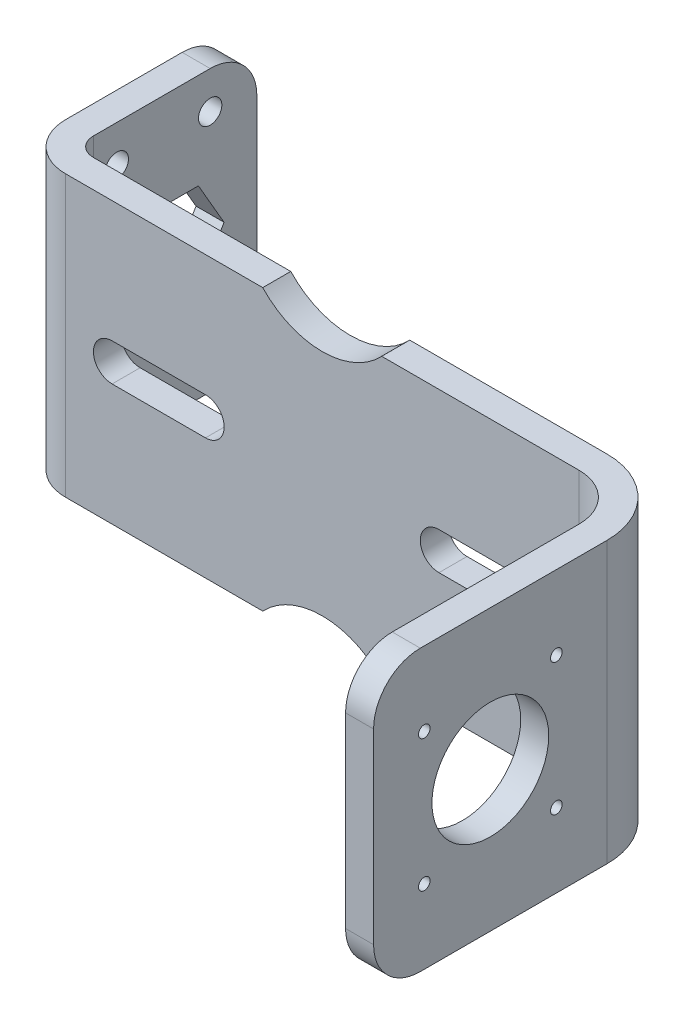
ISO-10303-21;
HEADER;
FILE_DESCRIPTION(('STEP AP214'),'2;1');
FILE_NAME('part.step','',(''),(''),'','','');
FILE_SCHEMA(('AUTOMOTIVE_DESIGN { 1 0 10303 214 1 1 1 1 }'));
ENDSEC;
DATA;
#1=APPLICATION_CONTEXT('core data for automotive mechanical design processes');
#2=APPLICATION_PROTOCOL_DEFINITION('international standard','automotive_design',2000,#1);
#3=PRODUCT_CONTEXT('',#1,'mechanical');
#4=PRODUCT('Part','Part','',(#3));
#5=PRODUCT_RELATED_PRODUCT_CATEGORY('part','',(#4));
#6=PRODUCT_DEFINITION_FORMATION('','',#4);
#7=PRODUCT_DEFINITION_CONTEXT('part definition',#1,'design');
#8=PRODUCT_DEFINITION('design','',#6,#7);
#9=PRODUCT_DEFINITION_SHAPE('','',#8);
#10=(LENGTH_UNIT() NAMED_UNIT(*) SI_UNIT(.MILLI.,.METRE.));
#11=(NAMED_UNIT(*) PLANE_ANGLE_UNIT() SI_UNIT($,.RADIAN.));
#12=(NAMED_UNIT(*) SI_UNIT($,.STERADIAN.) SOLID_ANGLE_UNIT());
#13=UNCERTAINTY_MEASURE_WITH_UNIT(LENGTH_MEASURE(1.E-05),#10,'distance_accuracy_value','');
#14=(GEOMETRIC_REPRESENTATION_CONTEXT(3) GLOBAL_UNCERTAINTY_ASSIGNED_CONTEXT((#13)) GLOBAL_UNIT_ASSIGNED_CONTEXT((#10,
#11,#12)) REPRESENTATION_CONTEXT('',''));
#15=CARTESIAN_POINT('',(0.,0.,0.));
#16=DIRECTION('',(0.,0.,1.));
#17=DIRECTION('',(1.,0.,0.));
#18=AXIS2_PLACEMENT_3D('',#15,#16,#17);
#19=CARTESIAN_POINT('',(-55.,60.,-70.));
#20=DIRECTION('',(0.,-1.,0.));
#21=DIRECTION('',(-1.,0.,0.));
#22=AXIS2_PLACEMENT_3D('',#19,#20,#21);
#23=PLANE('',#22);
#24=DIRECTION('',(0.,0.,-1.));
#25=VECTOR('',#24,1.);
#26=CARTESIAN_POINT('',(65.,60.,-49.9999999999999));
#27=LINE('',#26,#25);
#28=CARTESIAN_POINT('',(65.,60.,-10.));
#29=VERTEX_POINT('',#28);
#30=CARTESIAN_POINT('',(65.,60.,-49.9999999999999));
#31=VERTEX_POINT('',#30);
#32=EDGE_CURVE('E441',#29,#31,#27,.T.);
#33=ORIENTED_EDGE('',*,*,#32,.F.);
#34=DIRECTION('',(-1.,0.,0.));
#35=VECTOR('',#34,1.);
#36=CARTESIAN_POINT('',(71.,60.,-10.));
#37=LINE('',#36,#35);
#38=CARTESIAN_POINT('',(71.,60.,-10.));
#39=VERTEX_POINT('',#38);
#40=EDGE_CURVE('E571',#29,#39,#37,.F.);
#41=ORIENTED_EDGE('',*,*,#40,.T.);
#42=DIRECTION('',(0.,0.,-1.));
#43=VECTOR('',#42,1.);
#44=CARTESIAN_POINT('',(71.,60.,-49.9999999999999));
#45=LINE('',#44,#43);
#46=CARTESIAN_POINT('',(71.,60.,-49.9999999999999));
#47=VERTEX_POINT('',#46);
#48=EDGE_CURVE('E443',#39,#47,#45,.T.);
#49=ORIENTED_EDGE('',*,*,#48,.T.);
#50=CARTESIAN_POINT('',(55.,60.,-50.));
#51=DIRECTION('',(0.,1.,0.));
#52=DIRECTION('',(1.,0.,0.));
#53=AXIS2_PLACEMENT_3D('',#50,#51,#52);
#54=CIRCLE('',#53,16.);
#55=CARTESIAN_POINT('',(54.9999999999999,60.,-66.));
#56=VERTEX_POINT('',#55);
#57=EDGE_CURVE('E445',#47,#56,#54,.T.);
#58=ORIENTED_EDGE('',*,*,#57,.T.);
#59=DIRECTION('',(-1.,0.,0.));
#60=VECTOR('',#59,1.);
#61=CARTESIAN_POINT('',(0.,60.,-66.));
#62=LINE('',#61,#60);
#63=CARTESIAN_POINT('',(12.737739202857,60.,-66.));
#64=VERTEX_POINT('',#63);
#65=EDGE_CURVE('E448',#56,#64,#62,.T.);
#66=ORIENTED_EDGE('',*,*,#65,.T.);
#67=DIRECTION('',(0.,0.,1.));
#68=VECTOR('',#67,1.);
#69=CARTESIAN_POINT('',(12.737739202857,60.,-105.));
#70=LINE('',#69,#68);
#71=CARTESIAN_POINT('',(12.737739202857,60.,-60.));
#72=VERTEX_POINT('',#71);
#73=EDGE_CURVE('E552',#64,#72,#70,.T.);
#74=ORIENTED_EDGE('',*,*,#73,.T.);
#75=DIRECTION('',(-1.,0.,0.));
#76=VECTOR('',#75,1.);
#77=CARTESIAN_POINT('',(0.,60.,-60.));
#78=LINE('',#77,#76);
#79=CARTESIAN_POINT('',(54.9999999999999,60.,-60.));
#80=VERTEX_POINT('',#79);
#81=EDGE_CURVE('E435',#80,#72,#78,.T.);
#82=ORIENTED_EDGE('',*,*,#81,.F.);
#83=CARTESIAN_POINT('',(55.,60.,-50.));
#84=DIRECTION('',(0.,1.,0.));
#85=DIRECTION('',(0.,0.,-1.));
#86=AXIS2_PLACEMENT_3D('',#83,#84,#85);
#87=CIRCLE('',#86,10.);
#88=EDGE_CURVE('E438',#31,#80,#87,.T.);
#89=ORIENTED_EDGE('',*,*,#88,.F.);
#90=EDGE_LOOP('',(#33,#41,#49,#58,#66,#74,#82,#89));
#91=FACE_BOUND('',#90,.T.);
#92=ADVANCED_FACE('F50',(#91),#23,.F.);
#93=CARTESIAN_POINT('',(-55.,0.,-70.));
#94=DIRECTION('',(0.,-1.,0.));
#95=DIRECTION('',(-1.,0.,0.));
#96=AXIS2_PLACEMENT_3D('',#93,#94,#95);
#97=PLANE('',#96);
#98=DIRECTION('',(0.,0.,-1.));
#99=VECTOR('',#98,1.);
#100=CARTESIAN_POINT('',(71.,0.,-49.9999999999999));
#101=LINE('',#100,#99);
#102=CARTESIAN_POINT('',(71.,0.,-9.99999999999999));
#103=VERTEX_POINT('',#102);
#104=CARTESIAN_POINT('',(71.,0.,-49.9999999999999));
#105=VERTEX_POINT('',#104);
#106=EDGE_CURVE('E471',#103,#105,#101,.T.);
#107=ORIENTED_EDGE('',*,*,#106,.F.);
#108=DIRECTION('',(-1.,0.,0.));
#109=VECTOR('',#108,1.);
#110=CARTESIAN_POINT('',(-55.,0.,-9.99999999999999));
#111=LINE('',#110,#109);
#112=CARTESIAN_POINT('',(65.,0.,-9.99999999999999));
#113=VERTEX_POINT('',#112);
#114=EDGE_CURVE('E555',#103,#113,#111,.T.);
#115=ORIENTED_EDGE('',*,*,#114,.T.);
#116=DIRECTION('',(0.,0.,-1.));
#117=VECTOR('',#116,1.);
#118=CARTESIAN_POINT('',(65.,0.,-49.9999999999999));
#119=LINE('',#118,#117);
#120=CARTESIAN_POINT('',(65.,0.,-49.9999999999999));
#121=VERTEX_POINT('',#120);
#122=EDGE_CURVE('E469',#113,#121,#119,.T.);
#123=ORIENTED_EDGE('',*,*,#122,.T.);
#124=CARTESIAN_POINT('',(55.,0.,-50.));
#125=DIRECTION('',(0.,1.,0.));
#126=DIRECTION('',(0.,0.,-1.));
#127=AXIS2_PLACEMENT_3D('',#124,#125,#126);
#128=CIRCLE('',#127,10.);
#129=CARTESIAN_POINT('',(54.9999999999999,0.,-60.));
#130=VERTEX_POINT('',#129);
#131=EDGE_CURVE('E466',#121,#130,#128,.T.);
#132=ORIENTED_EDGE('',*,*,#131,.T.);
#133=DIRECTION('',(-1.,0.,0.));
#134=VECTOR('',#133,1.);
#135=CARTESIAN_POINT('',(0.,0.,-60.));
#136=LINE('',#135,#134);
#137=CARTESIAN_POINT('',(12.737739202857,0.,-60.));
#138=VERTEX_POINT('',#137);
#139=EDGE_CURVE('E463',#130,#138,#136,.T.);
#140=ORIENTED_EDGE('',*,*,#139,.T.);
#141=DIRECTION('',(0.,0.,1.));
#142=VECTOR('',#141,1.);
#143=CARTESIAN_POINT('',(12.737739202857,0.,-105.));
#144=LINE('',#143,#142);
#145=CARTESIAN_POINT('',(12.737739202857,0.,-66.));
#146=VERTEX_POINT('',#145);
#147=EDGE_CURVE('E547',#146,#138,#144,.T.);
#148=ORIENTED_EDGE('',*,*,#147,.F.);
#149=DIRECTION('',(-1.,0.,0.));
#150=VECTOR('',#149,1.);
#151=CARTESIAN_POINT('',(0.,0.,-66.));
#152=LINE('',#151,#150);
#153=CARTESIAN_POINT('',(54.9999999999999,0.,-66.));
#154=VERTEX_POINT('',#153);
#155=EDGE_CURVE('E477',#154,#146,#152,.T.);
#156=ORIENTED_EDGE('',*,*,#155,.F.);
#157=CARTESIAN_POINT('',(55.,0.,-50.));
#158=DIRECTION('',(0.,1.,0.));
#159=DIRECTION('',(1.,0.,0.));
#160=AXIS2_PLACEMENT_3D('',#157,#158,#159);
#161=CIRCLE('',#160,16.);
#162=EDGE_CURVE('E473',#105,#154,#161,.T.);
#163=ORIENTED_EDGE('',*,*,#162,.F.);
#164=EDGE_LOOP('',(#107,#115,#123,#132,#140,#148,#156,#163));
#165=FACE_BOUND('',#164,.T.);
#166=ADVANCED_FACE('F625',(#165),#97,.T.);
#167=CARTESIAN_POINT('',(0.,60.,-60.));
#168=DIRECTION('',(0.,0.,1.));
#169=DIRECTION('',(1.,0.,0.));
#170=AXIS2_PLACEMENT_3D('',#167,#168,#169);
#171=PLANE('',#170);
#172=CARTESIAN_POINT('',(0.,72.,-60.));
#173=DIRECTION('',(0.,0.,1.));
#174=DIRECTION('',(1.,0.,0.));
#175=AXIS2_PLACEMENT_3D('',#172,#173,#174);
#176=CIRCLE('',#175,17.5);
#177=CARTESIAN_POINT('',(-12.737739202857,60.,-60.));
#178=VERTEX_POINT('',#177);
#179=EDGE_CURVE('E333',#178,#72,#176,.T.);
#180=ORIENTED_EDGE('',*,*,#179,.F.);
#181=CARTESIAN_POINT('',(-54.9999999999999,60.,-60.));
#182=VERTEX_POINT('',#181);
#183=EDGE_CURVE('E434',#178,#182,#78,.T.);
#184=ORIENTED_EDGE('',*,*,#183,.T.);
#185=DIRECTION('',(0.,-1.,0.));
#186=VECTOR('',#185,1.);
#187=CARTESIAN_POINT('',(-54.9999999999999,60.,-60.));
#188=LINE('',#187,#186);
#189=CARTESIAN_POINT('',(-54.9999999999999,0.,-60.));
#190=VERTEX_POINT('',#189);
#191=EDGE_CURVE('E503',#182,#190,#188,.T.);
#192=ORIENTED_EDGE('',*,*,#191,.T.);
#193=CARTESIAN_POINT('',(-12.737739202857,0.,-60.));
#194=VERTEX_POINT('',#193);
#195=EDGE_CURVE('E462',#194,#190,#136,.T.);
#196=ORIENTED_EDGE('',*,*,#195,.F.);
#197=CARTESIAN_POINT('',(0.,-12.,-60.));
#198=DIRECTION('',(0.,0.,1.));
#199=DIRECTION('',(-1.,0.,0.));
#200=AXIS2_PLACEMENT_3D('',#197,#198,#199);
#201=CIRCLE('',#200,17.5);
#202=EDGE_CURVE('E325',#138,#194,#201,.T.);
#203=ORIENTED_EDGE('',*,*,#202,.F.);
#204=ORIENTED_EDGE('',*,*,#139,.F.);
#205=DIRECTION('',(0.,-1.,0.));
#206=VECTOR('',#205,1.);
#207=CARTESIAN_POINT('',(54.9999999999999,60.,-60.));
#208=LINE('',#207,#206);
#209=EDGE_CURVE('E501',#80,#130,#208,.T.);
#210=ORIENTED_EDGE('',*,*,#209,.F.);
#211=ORIENTED_EDGE('',*,*,#81,.T.);
#212=EDGE_LOOP('',(#180,#184,#192,#196,#203,#204,#210,#211));
#213=FACE_BOUND('',#212,.T.);
#214=CARTESIAN_POINT('',(-45.,30.,-60.));
#215=DIRECTION('',(0.,0.,1.));
#216=DIRECTION('',(1.,0.,0.));
#217=AXIS2_PLACEMENT_3D('',#214,#215,#216);
#218=CIRCLE('',#217,4.);
#219=CARTESIAN_POINT('',(-45.,34.,-60.));
#220=VERTEX_POINT('',#219);
#221=CARTESIAN_POINT('',(-45.,26.,-60.));
#222=VERTEX_POINT('',#221);
#223=EDGE_CURVE('E357',#220,#222,#218,.T.);
#224=ORIENTED_EDGE('',*,*,#223,.F.);
#225=DIRECTION('',(-1.,0.,0.));
#226=VECTOR('',#225,1.);
#227=CARTESIAN_POINT('',(-45.,34.,-60.));
#228=LINE('',#227,#226);
#229=CARTESIAN_POINT('',(-25.,34.,-60.));
#230=VERTEX_POINT('',#229);
#231=EDGE_CURVE('E371',#230,#220,#228,.T.);
#232=ORIENTED_EDGE('',*,*,#231,.F.);
#233=CARTESIAN_POINT('',(-25.,30.,-60.));
#234=DIRECTION('',(0.,0.,1.));
#235=DIRECTION('',(1.,0.,0.));
#236=AXIS2_PLACEMENT_3D('',#233,#234,#235);
#237=CIRCLE('',#236,4.);
#238=CARTESIAN_POINT('',(-25.,26.,-60.));
#239=VERTEX_POINT('',#238);
#240=EDGE_CURVE('E368',#239,#230,#237,.T.);
#241=ORIENTED_EDGE('',*,*,#240,.F.);
#242=DIRECTION('',(1.,0.,0.));
#243=VECTOR('',#242,1.);
#244=CARTESIAN_POINT('',(-45.,26.,-60.));
#245=LINE('',#244,#243);
#246=EDGE_CURVE('E365',#222,#239,#245,.T.);
#247=ORIENTED_EDGE('',*,*,#246,.F.);
#248=EDGE_LOOP('',(#224,#232,#241,#247));
#249=FACE_BOUND('',#248,.T.);
#250=DIRECTION('',(1.,0.,0.));
#251=VECTOR('',#250,1.);
#252=CARTESIAN_POINT('',(45.,34.,-60.));
#253=LINE('',#252,#251);
#254=CARTESIAN_POINT('',(25.,34.,-60.));
#255=VERTEX_POINT('',#254);
#256=CARTESIAN_POINT('',(45.,34.,-60.));
#257=VERTEX_POINT('',#256);
#258=EDGE_CURVE('E345',#255,#257,#253,.T.);
#259=ORIENTED_EDGE('',*,*,#258,.T.);
#260=CARTESIAN_POINT('',(45.,30.,-60.));
#261=DIRECTION('',(0.,0.,-1.));
#262=DIRECTION('',(-1.,0.,0.));
#263=AXIS2_PLACEMENT_3D('',#260,#261,#262);
#264=CIRCLE('',#263,4.);
#265=CARTESIAN_POINT('',(45.,26.,-60.));
#266=VERTEX_POINT('',#265);
#267=EDGE_CURVE('E342',#257,#266,#264,.T.);
#268=ORIENTED_EDGE('',*,*,#267,.T.);
#269=DIRECTION('',(-1.,0.,0.));
#270=VECTOR('',#269,1.);
#271=CARTESIAN_POINT('',(45.,26.,-60.));
#272=LINE('',#271,#270);
#273=CARTESIAN_POINT('',(25.,26.,-60.));
#274=VERTEX_POINT('',#273);
#275=EDGE_CURVE('E351',#266,#274,#272,.T.);
#276=ORIENTED_EDGE('',*,*,#275,.T.);
#277=CARTESIAN_POINT('',(25.,30.,-60.));
#278=DIRECTION('',(0.,0.,-1.));
#279=DIRECTION('',(-1.,0.,0.));
#280=AXIS2_PLACEMENT_3D('',#277,#278,#279);
#281=CIRCLE('',#280,4.);
#282=EDGE_CURVE('E348',#274,#255,#281,.T.);
#283=ORIENTED_EDGE('',*,*,#282,.T.);
#284=EDGE_LOOP('',(#259,#268,#276,#283));
#285=FACE_BOUND('',#284,.T.);
#286=ADVANCED_FACE('F632',(#213,#249,#285),#171,.T.);
#287=CARTESIAN_POINT('',(0.,60.,-66.));
#288=DIRECTION('',(0.,0.,1.));
#289=DIRECTION('',(1.,0.,0.));
#290=AXIS2_PLACEMENT_3D('',#287,#288,#289);
#291=PLANE('',#290);
#292=CARTESIAN_POINT('',(-12.737739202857,60.,-66.));
#293=VERTEX_POINT('',#292);
#294=CARTESIAN_POINT('',(-55.,60.,-66.));
#295=VERTEX_POINT('',#294);
#296=EDGE_CURVE('E447',#293,#295,#62,.T.);
#297=ORIENTED_EDGE('',*,*,#296,.F.);
#298=CARTESIAN_POINT('',(0.,72.,-66.));
#299=DIRECTION('',(0.,0.,1.));
#300=DIRECTION('',(1.,0.,0.));
#301=AXIS2_PLACEMENT_3D('',#298,#299,#300);
#302=CIRCLE('',#301,17.5);
#303=EDGE_CURVE('E339',#293,#64,#302,.T.);
#304=ORIENTED_EDGE('',*,*,#303,.T.);
#305=ORIENTED_EDGE('',*,*,#65,.F.);
#306=DIRECTION('',(0.,-1.,0.));
#307=VECTOR('',#306,1.);
#308=CARTESIAN_POINT('',(54.9999999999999,60.,-66.));
#309=LINE('',#308,#307);
#310=EDGE_CURVE('E486',#56,#154,#309,.T.);
#311=ORIENTED_EDGE('',*,*,#310,.T.);
#312=ORIENTED_EDGE('',*,*,#155,.T.);
#313=CARTESIAN_POINT('',(0.,-12.,-66.));
#314=DIRECTION('',(0.,0.,1.));
#315=DIRECTION('',(1.,0.,0.));
#316=AXIS2_PLACEMENT_3D('',#313,#314,#315);
#317=CIRCLE('',#316,17.5);
#318=CARTESIAN_POINT('',(-12.737739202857,0.,-66.));
#319=VERTEX_POINT('',#318);
#320=EDGE_CURVE('E335',#146,#319,#317,.T.);
#321=ORIENTED_EDGE('',*,*,#320,.T.);
#322=CARTESIAN_POINT('',(-55.,0.,-66.));
#323=VERTEX_POINT('',#322);
#324=EDGE_CURVE('E476',#319,#323,#152,.T.);
#325=ORIENTED_EDGE('',*,*,#324,.T.);
#326=DIRECTION('',(0.,-1.,0.));
#327=VECTOR('',#326,1.);
#328=CARTESIAN_POINT('',(-55.,60.,-66.));
#329=LINE('',#328,#327);
#330=EDGE_CURVE('E483',#295,#323,#329,.T.);
#331=ORIENTED_EDGE('',*,*,#330,.F.);
#332=EDGE_LOOP('',(#297,#304,#305,#311,#312,#321,#325,#331));
#333=FACE_BOUND('',#332,.T.);
#334=DIRECTION('',(-1.,0.,0.));
#335=VECTOR('',#334,1.);
#336=CARTESIAN_POINT('',(0.,34.,-66.));
#337=LINE('',#336,#335);
#338=CARTESIAN_POINT('',(-25.,34.,-66.));
#339=VERTEX_POINT('',#338);
#340=CARTESIAN_POINT('',(-45.,34.,-66.));
#341=VERTEX_POINT('',#340);
#342=EDGE_CURVE('E530',#339,#341,#337,.T.);
#343=ORIENTED_EDGE('',*,*,#342,.T.);
#344=CARTESIAN_POINT('',(-45.,30.,-66.));
#345=DIRECTION('',(0.,0.,1.));
#346=DIRECTION('',(1.,0.,0.));
#347=AXIS2_PLACEMENT_3D('',#344,#345,#346);
#348=CIRCLE('',#347,4.);
#349=CARTESIAN_POINT('',(-45.,26.,-66.));
#350=VERTEX_POINT('',#349);
#351=EDGE_CURVE('E533',#341,#350,#348,.T.);
#352=ORIENTED_EDGE('',*,*,#351,.T.);
#353=DIRECTION('',(1.,0.,0.));
#354=VECTOR('',#353,1.);
#355=CARTESIAN_POINT('',(0.,26.,-66.));
#356=LINE('',#355,#354);
#357=CARTESIAN_POINT('',(-25.,26.,-66.));
#358=VERTEX_POINT('',#357);
#359=EDGE_CURVE('E524',#350,#358,#356,.T.);
#360=ORIENTED_EDGE('',*,*,#359,.T.);
#361=CARTESIAN_POINT('',(-25.,30.,-66.));
#362=DIRECTION('',(0.,0.,1.));
#363=DIRECTION('',(1.,0.,0.));
#364=AXIS2_PLACEMENT_3D('',#361,#362,#363);
#365=CIRCLE('',#364,4.);
#366=EDGE_CURVE('E527',#358,#339,#365,.T.);
#367=ORIENTED_EDGE('',*,*,#366,.T.);
#368=EDGE_LOOP('',(#343,#352,#360,#367));
#369=FACE_BOUND('',#368,.T.);
#370=CARTESIAN_POINT('',(45.,30.,-66.));
#371=DIRECTION('',(0.,0.,1.));
#372=DIRECTION('',(1.,0.,0.));
#373=AXIS2_PLACEMENT_3D('',#370,#371,#372);
#374=CIRCLE('',#373,4.);
#375=CARTESIAN_POINT('',(45.,34.,-66.));
#376=VERTEX_POINT('',#375);
#377=CARTESIAN_POINT('',(45.,26.,-66.));
#378=VERTEX_POINT('',#377);
#379=EDGE_CURVE('E543',#376,#378,#374,.F.);
#380=ORIENTED_EDGE('',*,*,#379,.F.);
#381=DIRECTION('',(1.,0.,0.));
#382=VECTOR('',#381,1.);
#383=CARTESIAN_POINT('',(0.,34.,-66.));
#384=LINE('',#383,#382);
#385=CARTESIAN_POINT('',(25.,34.,-66.));
#386=VERTEX_POINT('',#385);
#387=EDGE_CURVE('E536',#386,#376,#384,.T.);
#388=ORIENTED_EDGE('',*,*,#387,.F.);
#389=CARTESIAN_POINT('',(25.,30.,-66.));
#390=DIRECTION('',(0.,0.,1.));
#391=DIRECTION('',(1.,0.,0.));
#392=AXIS2_PLACEMENT_3D('',#389,#390,#391);
#393=CIRCLE('',#392,4.);
#394=CARTESIAN_POINT('',(25.,26.,-66.));
#395=VERTEX_POINT('',#394);
#396=EDGE_CURVE('E538',#395,#386,#393,.F.);
#397=ORIENTED_EDGE('',*,*,#396,.F.);
#398=DIRECTION('',(-1.,0.,0.));
#399=VECTOR('',#398,1.);
#400=CARTESIAN_POINT('',(0.,26.,-66.));
#401=LINE('',#400,#399);
#402=EDGE_CURVE('E541',#378,#395,#401,.T.);
#403=ORIENTED_EDGE('',*,*,#402,.F.);
#404=EDGE_LOOP('',(#380,#388,#397,#403));
#405=FACE_BOUND('',#404,.T.);
#406=ADVANCED_FACE('F617',(#333,#369,#405),#291,.F.);
#407=CARTESIAN_POINT('',(-65.,7.00000000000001,-95.));
#408=DIRECTION('',(1.,0.,0.));
#409=DIRECTION('',(0.,0.,-1.));
#410=AXIS2_PLACEMENT_3D('',#407,#408,#409);
#411=CYLINDRICAL_SURFACE('',#410,2.50000000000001);
#412=CARTESIAN_POINT('',(-65.,7.00000000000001,-95.));
#413=DIRECTION('',(1.,0.,0.));
#414=DIRECTION('',(0.,0.,-1.));
#415=AXIS2_PLACEMENT_3D('',#412,#413,#414);
#416=CIRCLE('',#415,2.50000000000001);
#417=CARTESIAN_POINT('',(-65.,7.00000000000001,-97.5));
#418=VERTEX_POINT('',#417);
#419=EDGE_CURVE('E518',#418,#418,#416,.T.);
#420=ORIENTED_EDGE('',*,*,#419,.F.);
#421=EDGE_LOOP('',(#420));
#422=FACE_BOUND('',#421,.T.);
#423=CARTESIAN_POINT('',(-59.,7.00000000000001,-95.));
#424=DIRECTION('',(1.,0.,0.));
#425=DIRECTION('',(0.,0.,-1.));
#426=AXIS2_PLACEMENT_3D('',#423,#424,#425);
#427=CIRCLE('',#426,2.50000000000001);
#428=CARTESIAN_POINT('',(-59.,7.00000000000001,-97.5));
#429=VERTEX_POINT('',#428);
#430=EDGE_CURVE('E521',#429,#429,#427,.T.);
#431=ORIENTED_EDGE('',*,*,#430,.T.);
#432=EDGE_LOOP('',(#431));
#433=FACE_BOUND('',#432,.T.);
#434=ADVANCED_FACE('F704',(#422,#433),#411,.F.);
#435=CARTESIAN_POINT('',(-65.,7.00000000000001,-75.));
#436=DIRECTION('',(1.,0.,0.));
#437=DIRECTION('',(0.,0.,-1.));
#438=AXIS2_PLACEMENT_3D('',#435,#436,#437);
#439=CYLINDRICAL_SURFACE('',#438,2.50000000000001);
#440=CARTESIAN_POINT('',(-65.,7.00000000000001,-75.));
#441=DIRECTION('',(1.,0.,0.));
#442=DIRECTION('',(0.,0.,-1.));
#443=AXIS2_PLACEMENT_3D('',#440,#441,#442);
#444=CIRCLE('',#443,2.50000000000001);
#445=CARTESIAN_POINT('',(-65.,7.00000000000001,-77.5));
#446=VERTEX_POINT('',#445);
#447=EDGE_CURVE('E512',#446,#446,#444,.T.);
#448=ORIENTED_EDGE('',*,*,#447,.F.);
#449=EDGE_LOOP('',(#448));
#450=FACE_BOUND('',#449,.T.);
#451=CARTESIAN_POINT('',(-59.,7.00000000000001,-75.));
#452=DIRECTION('',(1.,0.,0.));
#453=DIRECTION('',(0.,0.,-1.));
#454=AXIS2_PLACEMENT_3D('',#451,#452,#453);
#455=CIRCLE('',#454,2.50000000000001);
#456=CARTESIAN_POINT('',(-59.,7.00000000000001,-77.5));
#457=VERTEX_POINT('',#456);
#458=EDGE_CURVE('E515',#457,#457,#455,.T.);
#459=ORIENTED_EDGE('',*,*,#458,.T.);
#460=EDGE_LOOP('',(#459));
#461=FACE_BOUND('',#460,.T.);
#462=ADVANCED_FACE('F709',(#450,#461),#439,.F.);
#463=CARTESIAN_POINT('',(71.,60.,-49.9999999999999));
#464=DIRECTION('',(-1.,0.,0.));
#465=DIRECTION('',(0.,0.,1.));
#466=AXIS2_PLACEMENT_3D('',#463,#464,#465);
#467=PLANE('',#466);
#468=CARTESIAN_POINT('',(71.,15.8578643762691,-39.142135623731));
#469=DIRECTION('',(1.,0.,0.));
#470=DIRECTION('',(0.,0.,-1.));
#471=AXIS2_PLACEMENT_3D('',#468,#469,#470);
#472=CIRCLE('',#471,1.24999999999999);
#473=CARTESIAN_POINT('',(71.,15.8578643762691,-40.392135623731));
#474=VERTEX_POINT('',#473);
#475=EDGE_CURVE('E401',#474,#474,#472,.T.);
#476=ORIENTED_EDGE('',*,*,#475,.F.);
#477=EDGE_LOOP('',(#476));
#478=FACE_BOUND('',#477,.T.);
#479=CARTESIAN_POINT('',(71.,15.857864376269,-10.8578643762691));
#480=DIRECTION('',(1.,0.,0.));
#481=DIRECTION('',(0.,0.,-1.));
#482=AXIS2_PLACEMENT_3D('',#479,#480,#481);
#483=CIRCLE('',#482,1.24999999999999);
#484=CARTESIAN_POINT('',(71.,15.857864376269,-12.1078643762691));
#485=VERTEX_POINT('',#484);
#486=EDGE_CURVE('E407',#485,#485,#483,.T.);
#487=ORIENTED_EDGE('',*,*,#486,.F.);
#488=EDGE_LOOP('',(#487));
#489=FACE_BOUND('',#488,.T.);
#490=CARTESIAN_POINT('',(71.,44.1421356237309,-10.857864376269));
#491=DIRECTION('',(1.,0.,0.));
#492=DIRECTION('',(0.,0.,-1.));
#493=AXIS2_PLACEMENT_3D('',#490,#491,#492);
#494=CIRCLE('',#493,1.24999999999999);
#495=CARTESIAN_POINT('',(71.,44.1421356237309,-12.107864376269));
#496=VERTEX_POINT('',#495);
#497=EDGE_CURVE('E413',#496,#496,#494,.T.);
#498=ORIENTED_EDGE('',*,*,#497,.F.);
#499=EDGE_LOOP('',(#498));
#500=FACE_BOUND('',#499,.T.);
#501=CARTESIAN_POINT('',(71.,30.,-25.));
#502=DIRECTION('',(1.,0.,0.));
#503=DIRECTION('',(0.,0.,-1.));
#504=AXIS2_PLACEMENT_3D('',#501,#502,#503);
#505=CIRCLE('',#504,12.5);
#506=CARTESIAN_POINT('',(71.,30.,-37.5));
#507=VERTEX_POINT('',#506);
#508=EDGE_CURVE('E419',#507,#507,#505,.T.);
#509=ORIENTED_EDGE('',*,*,#508,.F.);
#510=EDGE_LOOP('',(#509));
#511=FACE_BOUND('',#510,.T.);
#512=DIRECTION('',(0.,-1.,0.));
#513=VECTOR('',#512,1.);
#514=CARTESIAN_POINT('',(71.,60.,0.));
#515=LINE('',#514,#513);
#516=CARTESIAN_POINT('',(71.,50.,0.));
#517=VERTEX_POINT('',#516);
#518=CARTESIAN_POINT('',(71.,10.,0.));
#519=VERTEX_POINT('',#518);
#520=EDGE_CURVE('E492',#517,#519,#515,.T.);
#521=ORIENTED_EDGE('',*,*,#520,.T.);
#522=CARTESIAN_POINT('',(71.,10.,-9.99999999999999));
#523=DIRECTION('',(-1.,0.,0.));
#524=DIRECTION('',(0.,0.,1.));
#525=AXIS2_PLACEMENT_3D('',#522,#523,#524);
#526=CIRCLE('',#525,10.);
#527=EDGE_CURVE('E569',#519,#103,#526,.F.);
#528=ORIENTED_EDGE('',*,*,#527,.T.);
#529=ORIENTED_EDGE('',*,*,#106,.T.);
#530=DIRECTION('',(0.,-1.,0.));
#531=VECTOR('',#530,1.);
#532=CARTESIAN_POINT('',(71.,60.,-49.9999999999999));
#533=LINE('',#532,#531);
#534=EDGE_CURVE('E489',#47,#105,#533,.T.);
#535=ORIENTED_EDGE('',*,*,#534,.F.);
#536=ORIENTED_EDGE('',*,*,#48,.F.);
#537=CARTESIAN_POINT('',(71.,50.,-10.));
#538=DIRECTION('',(-1.,0.,0.));
#539=DIRECTION('',(0.,0.,1.));
#540=AXIS2_PLACEMENT_3D('',#537,#538,#539);
#541=CIRCLE('',#540,10.);
#542=EDGE_CURVE('E567',#39,#517,#541,.F.);
#543=ORIENTED_EDGE('',*,*,#542,.T.);
#544=EDGE_LOOP('',(#521,#528,#529,#535,#536,#543));
#545=FACE_BOUND('',#544,.T.);
#546=CARTESIAN_POINT('',(71.,44.142135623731,-39.1421356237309));
#547=DIRECTION('',(1.,0.,0.));
#548=DIRECTION('',(0.,0.,-1.));
#549=AXIS2_PLACEMENT_3D('',#546,#547,#548);
#550=CIRCLE('',#549,1.24999999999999);
#551=CARTESIAN_POINT('',(71.,44.142135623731,-40.3921356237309));
#552=VERTEX_POINT('',#551);
#553=EDGE_CURVE('E393',#552,#552,#550,.T.);
#554=ORIENTED_EDGE('',*,*,#553,.F.);
#555=EDGE_LOOP('',(#554));
#556=FACE_BOUND('',#555,.T.);
#557=ADVANCED_FACE('F706',(#478,#489,#500,#511,#545,#556),#467,.F.);
#558=CARTESIAN_POINT('',(-59.,60.,-70.0000000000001));
#559=DIRECTION('',(-1.,0.,0.));
#560=DIRECTION('',(0.,0.,1.));
#561=AXIS2_PLACEMENT_3D('',#558,#559,#560);
#562=PLANE('',#561);
#563=DIRECTION('',(0.,0.866025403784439,-0.499999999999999));
#564=VECTOR('',#563,1.);
#565=CARTESIAN_POINT('',(-59.,20.5,-92.4848275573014));
#566=LINE('',#565,#564);
#567=CARTESIAN_POINT('',(-59.,20.5,-92.4848275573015));
#568=VERTEX_POINT('',#567);
#569=CARTESIAN_POINT('',(-59.,30.,-97.9696551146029));
#570=VERTEX_POINT('',#569);
#571=EDGE_CURVE('E313',#568,#570,#566,.T.);
#572=ORIENTED_EDGE('',*,*,#571,.F.);
#573=DIRECTION('',(0.,0.,-1.));
#574=VECTOR('',#573,1.);
#575=CARTESIAN_POINT('',(-59.,20.5,-81.5151724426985));
#576=LINE('',#575,#574);
#577=CARTESIAN_POINT('',(-59.,20.5,-81.5151724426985));
#578=VERTEX_POINT('',#577);
#579=EDGE_CURVE('E280',#578,#568,#576,.T.);
#580=ORIENTED_EDGE('',*,*,#579,.F.);
#581=DIRECTION('',(0.,-0.866025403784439,-0.499999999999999));
#582=VECTOR('',#581,1.);
#583=CARTESIAN_POINT('',(-59.,30.,-76.0303448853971));
#584=LINE('',#583,#582);
#585=CARTESIAN_POINT('',(-59.,30.,-76.0303448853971));
#586=VERTEX_POINT('',#585);
#587=EDGE_CURVE('E299',#586,#578,#584,.T.);
#588=ORIENTED_EDGE('',*,*,#587,.F.);
#589=DIRECTION('',(0.,-0.866025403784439,0.5));
#590=VECTOR('',#589,1.);
#591=CARTESIAN_POINT('',(-59.,39.5,-81.5151724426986));
#592=LINE('',#591,#590);
#593=CARTESIAN_POINT('',(-59.,39.5,-81.5151724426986));
#594=VERTEX_POINT('',#593);
#595=EDGE_CURVE('E302',#594,#586,#592,.T.);
#596=ORIENTED_EDGE('',*,*,#595,.F.);
#597=DIRECTION('',(0.,0.,1.));
#598=VECTOR('',#597,1.);
#599=CARTESIAN_POINT('',(-59.,39.5,-92.4848275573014));
#600=LINE('',#599,#598);
#601=CARTESIAN_POINT('',(-59.,39.5,-92.4848275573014));
#602=VERTEX_POINT('',#601);
#603=EDGE_CURVE('E318',#602,#594,#600,.T.);
#604=ORIENTED_EDGE('',*,*,#603,.F.);
#605=DIRECTION('',(0.,0.866025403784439,0.499999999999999));
#606=VECTOR('',#605,1.);
#607=CARTESIAN_POINT('',(-59.,30.,-97.9696551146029));
#608=LINE('',#607,#606);
#609=EDGE_CURVE('E315',#570,#602,#608,.T.);
#610=ORIENTED_EDGE('',*,*,#609,.F.);
#611=EDGE_LOOP('',(#572,#580,#588,#596,#604,#610));
#612=FACE_BOUND('',#611,.T.);
#613=CARTESIAN_POINT('',(-59.,52.,-95.));
#614=DIRECTION('',(1.,0.,0.));
#615=DIRECTION('',(0.,0.,-1.));
#616=AXIS2_PLACEMENT_3D('',#613,#614,#615);
#617=CIRCLE('',#616,2.50000000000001);
#618=CARTESIAN_POINT('',(-59.,52.,-97.5));
#619=VERTEX_POINT('',#618);
#620=EDGE_CURVE('E386',#619,#619,#617,.T.);
#621=ORIENTED_EDGE('',*,*,#620,.F.);
#622=EDGE_LOOP('',(#621));
#623=FACE_BOUND('',#622,.T.);
#624=CARTESIAN_POINT('',(-59.,52.,-75.));
#625=DIRECTION('',(1.,0.,0.));
#626=DIRECTION('',(0.,0.,-1.));
#627=AXIS2_PLACEMENT_3D('',#624,#625,#626);
#628=CIRCLE('',#627,2.50000000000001);
#629=CARTESIAN_POINT('',(-59.,52.,-77.5));
#630=VERTEX_POINT('',#629);
#631=EDGE_CURVE('E389',#630,#630,#628,.T.);
#632=ORIENTED_EDGE('',*,*,#631,.F.);
#633=EDGE_LOOP('',(#632));
#634=FACE_BOUND('',#633,.T.);
#635=DIRECTION('',(0.,0.,-1.));
#636=VECTOR('',#635,1.);
#637=CARTESIAN_POINT('',(-59.,0.,-70.0000000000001));
#638=LINE('',#637,#636);
#639=CARTESIAN_POINT('',(-59.,0.,-70.0000000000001));
#640=VERTEX_POINT('',#639);
#641=CARTESIAN_POINT('',(-59.,0.,-95.));
#642=VERTEX_POINT('',#641);
#643=EDGE_CURVE('E425',#640,#642,#638,.T.);
#644=ORIENTED_EDGE('',*,*,#643,.T.);
#645=CARTESIAN_POINT('',(-59.,10.,-95.));
#646=DIRECTION('',(-1.,0.,0.));
#647=DIRECTION('',(0.,0.,1.));
#648=AXIS2_PLACEMENT_3D('',#645,#646,#647);
#649=CIRCLE('',#648,10.);
#650=CARTESIAN_POINT('',(-59.,10.,-105.));
#651=VERTEX_POINT('',#650);
#652=EDGE_CURVE('E578',#642,#651,#649,.F.);
#653=ORIENTED_EDGE('',*,*,#652,.T.);
#654=DIRECTION('',(0.,-1.,0.));
#655=VECTOR('',#654,1.);
#656=CARTESIAN_POINT('',(-59.,60.,-105.));
#657=LINE('',#656,#655);
#658=CARTESIAN_POINT('',(-59.,50.,-105.));
#659=VERTEX_POINT('',#658);
#660=EDGE_CURVE('E510',#659,#651,#657,.T.);
#661=ORIENTED_EDGE('',*,*,#660,.F.);
#662=CARTESIAN_POINT('',(-59.,50.,-95.));
#663=DIRECTION('',(-1.,0.,0.));
#664=DIRECTION('',(0.,0.,1.));
#665=AXIS2_PLACEMENT_3D('',#662,#663,#664);
#666=CIRCLE('',#665,10.);
#667=CARTESIAN_POINT('',(-59.,60.,-95.));
#668=VERTEX_POINT('',#667);
#669=EDGE_CURVE('E576',#659,#668,#666,.F.);
#670=ORIENTED_EDGE('',*,*,#669,.T.);
#671=DIRECTION('',(0.,0.,-1.));
#672=VECTOR('',#671,1.);
#673=CARTESIAN_POINT('',(-59.,60.,-70.0000000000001));
#674=LINE('',#673,#672);
#675=CARTESIAN_POINT('',(-59.,60.,-70.0000000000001));
#676=VERTEX_POINT('',#675);
#677=EDGE_CURVE('E426',#676,#668,#674,.T.);
#678=ORIENTED_EDGE('',*,*,#677,.F.);
#679=DIRECTION('',(0.,-1.,0.));
#680=VECTOR('',#679,1.);
#681=CARTESIAN_POINT('',(-59.,60.,-70.0000000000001));
#682=LINE('',#681,#680);
#683=EDGE_CURVE('E453',#676,#640,#682,.T.);
#684=ORIENTED_EDGE('',*,*,#683,.T.);
#685=EDGE_LOOP('',(#644,#653,#661,#670,#678,#684));
#686=FACE_BOUND('',#685,.T.);
#687=ORIENTED_EDGE('',*,*,#458,.F.);
#688=EDGE_LOOP('',(#687));
#689=FACE_BOUND('',#688,.T.);
#690=ORIENTED_EDGE('',*,*,#430,.F.);
#691=EDGE_LOOP('',(#690));
#692=FACE_BOUND('',#691,.T.);
#693=ADVANCED_FACE('F598',(#612,#623,#634,#686,#689,#692),#562,.F.);
#694=CARTESIAN_POINT('',(-65.,60.,-105.));
#695=DIRECTION('',(0.,0.,-1.));
#696=DIRECTION('',(-1.,0.,0.));
#697=AXIS2_PLACEMENT_3D('',#694,#695,#696);
#698=PLANE('',#697);
#699=ORIENTED_EDGE('',*,*,#660,.T.);
#700=DIRECTION('',(1.,0.,0.));
#701=VECTOR('',#700,1.);
#702=CARTESIAN_POINT('',(-65.,10.,-105.));
#703=LINE('',#702,#701);
#704=CARTESIAN_POINT('',(-65.,10.,-105.));
#705=VERTEX_POINT('',#704);
#706=EDGE_CURVE('E71',#651,#705,#703,.F.);
#707=ORIENTED_EDGE('',*,*,#706,.T.);
#708=DIRECTION('',(0.,-1.,0.));
#709=VECTOR('',#708,1.);
#710=CARTESIAN_POINT('',(-65.,60.,-105.));
#711=LINE('',#710,#709);
#712=CARTESIAN_POINT('',(-65.,50.,-105.));
#713=VERTEX_POINT('',#712);
#714=EDGE_CURVE('E508',#713,#705,#711,.T.);
#715=ORIENTED_EDGE('',*,*,#714,.F.);
#716=DIRECTION('',(1.,0.,0.));
#717=VECTOR('',#716,1.);
#718=CARTESIAN_POINT('',(-59.,50.,-105.));
#719=LINE('',#718,#717);
#720=EDGE_CURVE('E580',#713,#659,#719,.T.);
#721=ORIENTED_EDGE('',*,*,#720,.T.);
#722=EDGE_LOOP('',(#699,#707,#715,#721));
#723=FACE_BOUND('',#722,.T.);
#724=ADVANCED_FACE('F600',(#723),#698,.T.);
#725=CARTESIAN_POINT('',(-65.,60.,-70.0000000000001));
#726=DIRECTION('',(-1.,0.,0.));
#727=DIRECTION('',(0.,0.,1.));
#728=AXIS2_PLACEMENT_3D('',#725,#726,#727);
#729=PLANE('',#728);
#730=DIRECTION('',(0.,0.,-1.));
#731=VECTOR('',#730,1.);
#732=CARTESIAN_POINT('',(-65.,20.5,-81.5151724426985));
#733=LINE('',#732,#731);
#734=CARTESIAN_POINT('',(-65.,20.5,-81.5151724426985));
#735=VERTEX_POINT('',#734);
#736=CARTESIAN_POINT('',(-65.,20.5,-92.4848275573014));
#737=VERTEX_POINT('',#736);
#738=EDGE_CURVE('E277',#735,#737,#733,.T.);
#739=ORIENTED_EDGE('',*,*,#738,.T.);
#740=DIRECTION('',(0.,0.866025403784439,-0.499999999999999));
#741=VECTOR('',#740,1.);
#742=CARTESIAN_POINT('',(-65.,20.5,-92.4848275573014));
#743=LINE('',#742,#741);
#744=CARTESIAN_POINT('',(-65.,30.,-97.9696551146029));
#745=VERTEX_POINT('',#744);
#746=EDGE_CURVE('E289',#737,#745,#743,.T.);
#747=ORIENTED_EDGE('',*,*,#746,.T.);
#748=DIRECTION('',(0.,0.866025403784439,0.499999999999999));
#749=VECTOR('',#748,1.);
#750=CARTESIAN_POINT('',(-65.,30.,-97.9696551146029));
#751=LINE('',#750,#749);
#752=CARTESIAN_POINT('',(-65.,39.5,-92.4848275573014));
#753=VERTEX_POINT('',#752);
#754=EDGE_CURVE('E293',#745,#753,#751,.T.);
#755=ORIENTED_EDGE('',*,*,#754,.T.);
#756=DIRECTION('',(0.,0.,1.));
#757=VECTOR('',#756,1.);
#758=CARTESIAN_POINT('',(-65.,39.5,-92.4848275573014));
#759=LINE('',#758,#757);
#760=CARTESIAN_POINT('',(-65.,39.5,-81.5151724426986));
#761=VERTEX_POINT('',#760);
#762=EDGE_CURVE('E306',#753,#761,#759,.T.);
#763=ORIENTED_EDGE('',*,*,#762,.T.);
#764=DIRECTION('',(0.,-0.866025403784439,0.5));
#765=VECTOR('',#764,1.);
#766=CARTESIAN_POINT('',(-65.,39.5,-81.5151724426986));
#767=LINE('',#766,#765);
#768=CARTESIAN_POINT('',(-65.,30.,-76.0303448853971));
#769=VERTEX_POINT('',#768);
#770=EDGE_CURVE('E309',#761,#769,#767,.T.);
#771=ORIENTED_EDGE('',*,*,#770,.T.);
#772=DIRECTION('',(0.,-0.866025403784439,-0.499999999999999));
#773=VECTOR('',#772,1.);
#774=CARTESIAN_POINT('',(-65.,30.,-76.0303448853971));
#775=LINE('',#774,#773);
#776=EDGE_CURVE('E285',#769,#735,#775,.T.);
#777=ORIENTED_EDGE('',*,*,#776,.T.);
#778=EDGE_LOOP('',(#739,#747,#755,#763,#771,#777));
#779=FACE_BOUND('',#778,.T.);
#780=CARTESIAN_POINT('',(-65.,52.,-95.));
#781=DIRECTION('',(1.,0.,0.));
#782=DIRECTION('',(0.,0.,-1.));
#783=AXIS2_PLACEMENT_3D('',#780,#781,#782);
#784=CIRCLE('',#783,2.50000000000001);
#785=CARTESIAN_POINT('',(-65.,52.,-97.5));
#786=VERTEX_POINT('',#785);
#787=EDGE_CURVE('E377',#786,#786,#784,.T.);
#788=ORIENTED_EDGE('',*,*,#787,.T.);
#789=EDGE_LOOP('',(#788));
#790=FACE_BOUND('',#789,.T.);
#791=CARTESIAN_POINT('',(-65.,52.,-75.));
#792=DIRECTION('',(1.,0.,0.));
#793=DIRECTION('',(0.,0.,-1.));
#794=AXIS2_PLACEMENT_3D('',#791,#792,#793);
#795=CIRCLE('',#794,2.50000000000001);
#796=CARTESIAN_POINT('',(-65.,52.,-77.5));
#797=VERTEX_POINT('',#796);
#798=EDGE_CURVE('E390',#797,#797,#795,.T.);
#799=ORIENTED_EDGE('',*,*,#798,.T.);
#800=EDGE_LOOP('',(#799));
#801=FACE_BOUND('',#800,.T.);
#802=ORIENTED_EDGE('',*,*,#714,.T.);
#803=CARTESIAN_POINT('',(-65.,10.,-95.));
#804=DIRECTION('',(-1.,0.,0.));
#805=DIRECTION('',(0.,0.,1.));
#806=AXIS2_PLACEMENT_3D('',#803,#804,#805);
#807=CIRCLE('',#806,10.);
#808=CARTESIAN_POINT('',(-65.,0.,-95.));
#809=VERTEX_POINT('',#808);
#810=EDGE_CURVE('E58',#705,#809,#807,.T.);
#811=ORIENTED_EDGE('',*,*,#810,.T.);
#812=DIRECTION('',(0.,0.,-1.));
#813=VECTOR('',#812,1.);
#814=CARTESIAN_POINT('',(-65.,0.,-70.0000000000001));
#815=LINE('',#814,#813);
#816=CARTESIAN_POINT('',(-65.,0.,-70.0000000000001));
#817=VERTEX_POINT('',#816);
#818=EDGE_CURVE('E456',#817,#809,#815,.T.);
#819=ORIENTED_EDGE('',*,*,#818,.F.);
#820=DIRECTION('',(0.,-1.,0.));
#821=VECTOR('',#820,1.);
#822=CARTESIAN_POINT('',(-65.,60.,-70.0000000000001));
#823=LINE('',#822,#821);
#824=CARTESIAN_POINT('',(-65.,60.,-70.0000000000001));
#825=VERTEX_POINT('',#824);
#826=EDGE_CURVE('E506',#825,#817,#823,.T.);
#827=ORIENTED_EDGE('',*,*,#826,.F.);
#828=DIRECTION('',(0.,0.,-1.));
#829=VECTOR('',#828,1.);
#830=CARTESIAN_POINT('',(-65.,60.,-70.0000000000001));
#831=LINE('',#830,#829);
#832=CARTESIAN_POINT('',(-65.,60.,-95.));
#833=VERTEX_POINT('',#832);
#834=EDGE_CURVE('E428',#825,#833,#831,.T.);
#835=ORIENTED_EDGE('',*,*,#834,.T.);
#836=CARTESIAN_POINT('',(-65.,50.,-95.));
#837=DIRECTION('',(-1.,0.,0.));
#838=DIRECTION('',(0.,0.,1.));
#839=AXIS2_PLACEMENT_3D('',#836,#837,#838);
#840=CIRCLE('',#839,10.);
#841=EDGE_CURVE('E584',#833,#713,#840,.T.);
#842=ORIENTED_EDGE('',*,*,#841,.T.);
#843=EDGE_LOOP('',(#802,#811,#819,#827,#835,#842));
#844=FACE_BOUND('',#843,.T.);
#845=ORIENTED_EDGE('',*,*,#447,.T.);
#846=EDGE_LOOP('',(#845));
#847=FACE_BOUND('',#846,.T.);
#848=ORIENTED_EDGE('',*,*,#419,.T.);
#849=EDGE_LOOP('',(#848));
#850=FACE_BOUND('',#849,.T.);
#851=ADVANCED_FACE('F295',(#779,#790,#801,#844,#847,#850),#729,.T.);
#852=CARTESIAN_POINT('',(-55.,60.,-70.));
#853=DIRECTION('',(0.,-1.,0.));
#854=DIRECTION('',(0.,0.,-1.));
#855=AXIS2_PLACEMENT_3D('',#852,#853,#854);
#856=CYLINDRICAL_SURFACE('',#855,9.99999999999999);
#857=CARTESIAN_POINT('',(-55.,0.,-70.));
#858=DIRECTION('',(0.,-1.,0.));
#859=DIRECTION('',(0.,0.,-1.));
#860=AXIS2_PLACEMENT_3D('',#857,#858,#859);
#861=CIRCLE('',#860,9.99999999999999);
#862=EDGE_CURVE('E459',#190,#817,#861,.T.);
#863=ORIENTED_EDGE('',*,*,#862,.F.);
#864=ORIENTED_EDGE('',*,*,#191,.F.);
#865=CARTESIAN_POINT('',(-55.,60.,-70.));
#866=DIRECTION('',(0.,-1.,0.));
#867=DIRECTION('',(0.,0.,-1.));
#868=AXIS2_PLACEMENT_3D('',#865,#866,#867);
#869=CIRCLE('',#868,9.99999999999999);
#870=EDGE_CURVE('E431',#182,#825,#869,.T.);
#871=ORIENTED_EDGE('',*,*,#870,.T.);
#872=ORIENTED_EDGE('',*,*,#826,.T.);
#873=EDGE_LOOP('',(#863,#864,#871,#872));
#874=FACE_BOUND('',#873,.T.);
#875=ADVANCED_FACE('F638',(#874),#856,.T.);
#876=CARTESIAN_POINT('',(55.,60.,-50.));
#877=DIRECTION('',(0.,-1.,0.));
#878=DIRECTION('',(0.,0.,-1.));
#879=AXIS2_PLACEMENT_3D('',#876,#877,#878);
#880=CYLINDRICAL_SURFACE('',#879,10.);
#881=ORIENTED_EDGE('',*,*,#131,.F.);
#882=DIRECTION('',(0.,-1.,0.));
#883=VECTOR('',#882,1.);
#884=CARTESIAN_POINT('',(65.,60.,-49.9999999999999));
#885=LINE('',#884,#883);
#886=EDGE_CURVE('E498',#31,#121,#885,.T.);
#887=ORIENTED_EDGE('',*,*,#886,.F.);
#888=ORIENTED_EDGE('',*,*,#88,.T.);
#889=ORIENTED_EDGE('',*,*,#209,.T.);
#890=EDGE_LOOP('',(#881,#887,#888,#889));
#891=FACE_BOUND('',#890,.T.);
#892=ADVANCED_FACE('F670',(#891),#880,.F.);
#893=CARTESIAN_POINT('',(65.,60.,-49.9999999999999));
#894=DIRECTION('',(-1.,0.,0.));
#895=DIRECTION('',(0.,0.,1.));
#896=AXIS2_PLACEMENT_3D('',#893,#894,#895);
#897=PLANE('',#896);
#898=CARTESIAN_POINT('',(65.,44.142135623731,-39.1421356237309));
#899=DIRECTION('',(-1.,0.,0.));
#900=DIRECTION('',(0.,0.,1.));
#901=AXIS2_PLACEMENT_3D('',#898,#899,#900);
#902=CIRCLE('',#901,1.24999999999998);
#903=CARTESIAN_POINT('',(65.,44.142135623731,-37.8921356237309));
#904=VERTEX_POINT('',#903);
#905=EDGE_CURVE('E398',#904,#904,#902,.T.);
#906=ORIENTED_EDGE('',*,*,#905,.F.);
#907=EDGE_LOOP('',(#906));
#908=FACE_BOUND('',#907,.T.);
#909=CARTESIAN_POINT('',(65.,15.8578643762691,-39.142135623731));
#910=DIRECTION('',(-1.,0.,0.));
#911=DIRECTION('',(0.,0.,1.));
#912=AXIS2_PLACEMENT_3D('',#909,#910,#911);
#913=CIRCLE('',#912,1.24999999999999);
#914=CARTESIAN_POINT('',(65.,15.8578643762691,-37.892135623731));
#915=VERTEX_POINT('',#914);
#916=EDGE_CURVE('E404',#915,#915,#913,.T.);
#917=ORIENTED_EDGE('',*,*,#916,.F.);
#918=EDGE_LOOP('',(#917));
#919=FACE_BOUND('',#918,.T.);
#920=CARTESIAN_POINT('',(65.,15.857864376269,-10.8578643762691));
#921=DIRECTION('',(-1.,0.,0.));
#922=DIRECTION('',(0.,0.,1.));
#923=AXIS2_PLACEMENT_3D('',#920,#921,#922);
#924=CIRCLE('',#923,1.24999999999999);
#925=CARTESIAN_POINT('',(65.,15.857864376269,-9.6078643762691));
#926=VERTEX_POINT('',#925);
#927=EDGE_CURVE('E410',#926,#926,#924,.T.);
#928=ORIENTED_EDGE('',*,*,#927,.F.);
#929=EDGE_LOOP('',(#928));
#930=FACE_BOUND('',#929,.T.);
#931=CARTESIAN_POINT('',(65.,44.1421356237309,-10.857864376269));
#932=DIRECTION('',(-1.,0.,0.));
#933=DIRECTION('',(0.,0.,1.));
#934=AXIS2_PLACEMENT_3D('',#931,#932,#933);
#935=CIRCLE('',#934,1.24999999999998);
#936=CARTESIAN_POINT('',(65.,44.1421356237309,-9.60786437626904));
#937=VERTEX_POINT('',#936);
#938=EDGE_CURVE('E416',#937,#937,#935,.T.);
#939=ORIENTED_EDGE('',*,*,#938,.F.);
#940=EDGE_LOOP('',(#939));
#941=FACE_BOUND('',#940,.T.);
#942=CARTESIAN_POINT('',(65.,30.,-25.));
#943=DIRECTION('',(-1.,0.,0.));
#944=DIRECTION('',(0.,0.,1.));
#945=AXIS2_PLACEMENT_3D('',#942,#943,#944);
#946=CIRCLE('',#945,12.5);
#947=CARTESIAN_POINT('',(65.,30.,-12.5));
#948=VERTEX_POINT('',#947);
#949=EDGE_CURVE('E422',#948,#948,#946,.T.);
#950=ORIENTED_EDGE('',*,*,#949,.F.);
#951=EDGE_LOOP('',(#950));
#952=FACE_BOUND('',#951,.T.);
#953=ORIENTED_EDGE('',*,*,#122,.F.);
#954=CARTESIAN_POINT('',(65.,10.,-9.99999999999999));
#955=DIRECTION('',(-1.,0.,0.));
#956=DIRECTION('',(0.,0.,1.));
#957=AXIS2_PLACEMENT_3D('',#954,#955,#956);
#958=CIRCLE('',#957,10.);
#959=CARTESIAN_POINT('',(65.,10.,0.));
#960=VERTEX_POINT('',#959);
#961=EDGE_CURVE('E560',#113,#960,#958,.T.);
#962=ORIENTED_EDGE('',*,*,#961,.T.);
#963=DIRECTION('',(0.,-1.,0.));
#964=VECTOR('',#963,1.);
#965=CARTESIAN_POINT('',(65.,60.,0.));
#966=LINE('',#965,#964);
#967=CARTESIAN_POINT('',(65.,50.,0.));
#968=VERTEX_POINT('',#967);
#969=EDGE_CURVE('E495',#968,#960,#966,.T.);
#970=ORIENTED_EDGE('',*,*,#969,.F.);
#971=CARTESIAN_POINT('',(65.,50.,-10.));
#972=DIRECTION('',(-1.,0.,0.));
#973=DIRECTION('',(0.,0.,1.));
#974=AXIS2_PLACEMENT_3D('',#971,#972,#973);
#975=CIRCLE('',#974,10.);
#976=EDGE_CURVE('E558',#968,#29,#975,.T.);
#977=ORIENTED_EDGE('',*,*,#976,.T.);
#978=ORIENTED_EDGE('',*,*,#32,.T.);
#979=ORIENTED_EDGE('',*,*,#886,.T.);
#980=EDGE_LOOP('',(#953,#962,#970,#977,#978,#979));
#981=FACE_BOUND('',#980,.T.);
#982=ADVANCED_FACE('F658',(#908,#919,#930,#941,#952,#981),#897,.T.);
#983=CARTESIAN_POINT('',(71.,60.,0.));
#984=DIRECTION('',(0.,0.,1.));
#985=DIRECTION('',(1.,0.,0.));
#986=AXIS2_PLACEMENT_3D('',#983,#984,#985);
#987=PLANE('',#986);
#988=ORIENTED_EDGE('',*,*,#969,.T.);
#989=DIRECTION('',(-1.,0.,0.));
#990=VECTOR('',#989,1.);
#991=CARTESIAN_POINT('',(71.,10.,0.));
#992=LINE('',#991,#990);
#993=EDGE_CURVE('E565',#960,#519,#992,.F.);
#994=ORIENTED_EDGE('',*,*,#993,.T.);
#995=ORIENTED_EDGE('',*,*,#520,.F.);
#996=DIRECTION('',(-1.,0.,0.));
#997=VECTOR('',#996,1.);
#998=CARTESIAN_POINT('',(65.,50.,0.));
#999=LINE('',#998,#997);
#1000=EDGE_CURVE('E562',#517,#968,#999,.T.);
#1001=ORIENTED_EDGE('',*,*,#1000,.T.);
#1002=EDGE_LOOP('',(#988,#994,#995,#1001));
#1003=FACE_BOUND('',#1002,.T.);
#1004=ADVANCED_FACE('F660',(#1003),#987,.T.);
#1005=CARTESIAN_POINT('',(55.,60.,-50.));
#1006=DIRECTION('',(0.,-1.,0.));
#1007=DIRECTION('',(0.,0.,-1.));
#1008=AXIS2_PLACEMENT_3D('',#1005,#1006,#1007);
#1009=CYLINDRICAL_SURFACE('',#1008,16.);
#1010=ORIENTED_EDGE('',*,*,#162,.T.);
#1011=ORIENTED_EDGE('',*,*,#310,.F.);
#1012=ORIENTED_EDGE('',*,*,#57,.F.);
#1013=ORIENTED_EDGE('',*,*,#534,.T.);
#1014=EDGE_LOOP('',(#1010,#1011,#1012,#1013));
#1015=FACE_BOUND('',#1014,.T.);
#1016=ADVANCED_FACE('F648',(#1015),#1009,.T.);
#1017=CARTESIAN_POINT('',(-55.,60.,-70.));
#1018=DIRECTION('',(0.,-1.,0.));
#1019=DIRECTION('',(0.,0.,-1.));
#1020=AXIS2_PLACEMENT_3D('',#1017,#1018,#1019);
#1021=CYLINDRICAL_SURFACE('',#1020,3.99999999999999);
#1022=CARTESIAN_POINT('',(-55.,0.,-70.));
#1023=DIRECTION('',(0.,1.,0.));
#1024=DIRECTION('',(1.,0.,0.));
#1025=AXIS2_PLACEMENT_3D('',#1022,#1023,#1024);
#1026=CIRCLE('',#1025,3.99999999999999);
#1027=EDGE_CURVE('E429',#323,#640,#1026,.F.);
#1028=ORIENTED_EDGE('',*,*,#1027,.T.);
#1029=ORIENTED_EDGE('',*,*,#683,.F.);
#1030=CARTESIAN_POINT('',(-55.,60.,-70.));
#1031=DIRECTION('',(0.,1.,0.));
#1032=DIRECTION('',(1.,0.,0.));
#1033=AXIS2_PLACEMENT_3D('',#1030,#1031,#1032);
#1034=CIRCLE('',#1033,3.99999999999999);
#1035=EDGE_CURVE('E451',#295,#676,#1034,.F.);
#1036=ORIENTED_EDGE('',*,*,#1035,.F.);
#1037=ORIENTED_EDGE('',*,*,#330,.T.);
#1038=EDGE_LOOP('',(#1028,#1029,#1036,#1037));
#1039=FACE_BOUND('',#1038,.T.);
#1040=ADVANCED_FACE('F611',(#1039),#1021,.F.);
#1041=ORIENTED_EDGE('',*,*,#677,.T.);
#1042=DIRECTION('',(1.,0.,0.));
#1043=VECTOR('',#1042,1.);
#1044=CARTESIAN_POINT('',(-65.,60.,-95.));
#1045=LINE('',#1044,#1043);
#1046=EDGE_CURVE('E13',#668,#833,#1045,.F.);
#1047=ORIENTED_EDGE('',*,*,#1046,.T.);
#1048=ORIENTED_EDGE('',*,*,#834,.F.);
#1049=ORIENTED_EDGE('',*,*,#870,.F.);
#1050=ORIENTED_EDGE('',*,*,#183,.F.);
#1051=DIRECTION('',(0.,0.,1.));
#1052=VECTOR('',#1051,1.);
#1053=CARTESIAN_POINT('',(-12.737739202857,60.,-105.));
#1054=LINE('',#1053,#1052);
#1055=EDGE_CURVE('E549',#178,#293,#1054,.F.);
#1056=ORIENTED_EDGE('',*,*,#1055,.T.);
#1057=ORIENTED_EDGE('',*,*,#296,.T.);
#1058=ORIENTED_EDGE('',*,*,#1035,.T.);
#1059=EDGE_LOOP('',(#1041,#1047,#1048,#1049,#1050,#1056,#1057,#1058));
#1060=FACE_BOUND('',#1059,.T.);
#1061=ADVANCED_FACE('F605',(#1060),#23,.F.);
#1062=ORIENTED_EDGE('',*,*,#818,.T.);
#1063=DIRECTION('',(1.,0.,0.));
#1064=VECTOR('',#1063,1.);
#1065=CARTESIAN_POINT('',(-55.,0.,-95.));
#1066=LINE('',#1065,#1064);
#1067=EDGE_CURVE('E573',#809,#642,#1066,.T.);
#1068=ORIENTED_EDGE('',*,*,#1067,.T.);
#1069=ORIENTED_EDGE('',*,*,#643,.F.);
#1070=ORIENTED_EDGE('',*,*,#1027,.F.);
#1071=ORIENTED_EDGE('',*,*,#324,.F.);
#1072=DIRECTION('',(0.,0.,1.));
#1073=VECTOR('',#1072,1.);
#1074=CARTESIAN_POINT('',(-12.737739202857,0.,-105.));
#1075=LINE('',#1074,#1073);
#1076=EDGE_CURVE('E545',#194,#319,#1075,.F.);
#1077=ORIENTED_EDGE('',*,*,#1076,.F.);
#1078=ORIENTED_EDGE('',*,*,#195,.T.);
#1079=ORIENTED_EDGE('',*,*,#862,.T.);
#1080=EDGE_LOOP('',(#1062,#1068,#1069,#1070,#1071,#1077,#1078,#1079));
#1081=FACE_BOUND('',#1080,.T.);
#1082=ADVANCED_FACE('F592',(#1081),#97,.T.);
#1083=CARTESIAN_POINT('',(-65.,30.,-25.));
#1084=DIRECTION('',(1.,0.,0.));
#1085=DIRECTION('',(0.,0.,-1.));
#1086=AXIS2_PLACEMENT_3D('',#1083,#1084,#1085);
#1087=CYLINDRICAL_SURFACE('',#1086,12.5);
#1088=ORIENTED_EDGE('',*,*,#949,.T.);
#1089=EDGE_LOOP('',(#1088));
#1090=FACE_BOUND('',#1089,.T.);
#1091=ORIENTED_EDGE('',*,*,#508,.T.);
#1092=EDGE_LOOP('',(#1091));
#1093=FACE_BOUND('',#1092,.T.);
#1094=ADVANCED_FACE('F695',(#1090,#1093),#1087,.F.);
#1095=CARTESIAN_POINT('',(71.,44.1421356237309,-10.857864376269));
#1096=DIRECTION('',(1.,0.,0.));
#1097=DIRECTION('',(0.,0.,-1.));
#1098=AXIS2_PLACEMENT_3D('',#1095,#1096,#1097);
#1099=CYLINDRICAL_SURFACE('',#1098,1.24999999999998);
#1100=ORIENTED_EDGE('',*,*,#938,.T.);
#1101=EDGE_LOOP('',(#1100));
#1102=FACE_BOUND('',#1101,.T.);
#1103=ORIENTED_EDGE('',*,*,#497,.T.);
#1104=EDGE_LOOP('',(#1103));
#1105=FACE_BOUND('',#1104,.T.);
#1106=ADVANCED_FACE('F784',(#1102,#1105),#1099,.F.);
#1107=CARTESIAN_POINT('',(71.,15.857864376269,-10.8578643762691));
#1108=DIRECTION('',(1.,0.,0.));
#1109=DIRECTION('',(0.,0.,-1.));
#1110=AXIS2_PLACEMENT_3D('',#1107,#1108,#1109);
#1111=CYLINDRICAL_SURFACE('',#1110,1.24999999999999);
#1112=ORIENTED_EDGE('',*,*,#927,.T.);
#1113=EDGE_LOOP('',(#1112));
#1114=FACE_BOUND('',#1113,.T.);
#1115=ORIENTED_EDGE('',*,*,#486,.T.);
#1116=EDGE_LOOP('',(#1115));
#1117=FACE_BOUND('',#1116,.T.);
#1118=ADVANCED_FACE('F796',(#1114,#1117),#1111,.F.);
#1119=CARTESIAN_POINT('',(71.,15.8578643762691,-39.142135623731));
#1120=DIRECTION('',(1.,0.,0.));
#1121=DIRECTION('',(0.,0.,-1.));
#1122=AXIS2_PLACEMENT_3D('',#1119,#1120,#1121);
#1123=CYLINDRICAL_SURFACE('',#1122,1.24999999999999);
#1124=ORIENTED_EDGE('',*,*,#916,.T.);
#1125=EDGE_LOOP('',(#1124));
#1126=FACE_BOUND('',#1125,.T.);
#1127=ORIENTED_EDGE('',*,*,#475,.T.);
#1128=EDGE_LOOP('',(#1127));
#1129=FACE_BOUND('',#1128,.T.);
#1130=ADVANCED_FACE('F810',(#1126,#1129),#1123,.F.);
#1131=CARTESIAN_POINT('',(71.,44.142135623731,-39.1421356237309));
#1132=DIRECTION('',(1.,0.,0.));
#1133=DIRECTION('',(0.,0.,-1.));
#1134=AXIS2_PLACEMENT_3D('',#1131,#1132,#1133);
#1135=CYLINDRICAL_SURFACE('',#1134,1.24999999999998);
#1136=ORIENTED_EDGE('',*,*,#905,.T.);
#1137=EDGE_LOOP('',(#1136));
#1138=FACE_BOUND('',#1137,.T.);
#1139=ORIENTED_EDGE('',*,*,#553,.T.);
#1140=EDGE_LOOP('',(#1139));
#1141=FACE_BOUND('',#1140,.T.);
#1142=ADVANCED_FACE('F824',(#1138,#1141),#1135,.F.);
#1143=CARTESIAN_POINT('',(-65.,52.,-75.));
#1144=DIRECTION('',(1.,0.,0.));
#1145=DIRECTION('',(0.,0.,-1.));
#1146=AXIS2_PLACEMENT_3D('',#1143,#1144,#1145);
#1147=CYLINDRICAL_SURFACE('',#1146,2.50000000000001);
#1148=ORIENTED_EDGE('',*,*,#798,.F.);
#1149=EDGE_LOOP('',(#1148));
#1150=FACE_BOUND('',#1149,.T.);
#1151=ORIENTED_EDGE('',*,*,#631,.T.);
#1152=EDGE_LOOP('',(#1151));
#1153=FACE_BOUND('',#1152,.T.);
#1154=ADVANCED_FACE('F837',(#1150,#1153),#1147,.F.);
#1155=CARTESIAN_POINT('',(-65.,52.,-95.));
#1156=DIRECTION('',(1.,0.,0.));
#1157=DIRECTION('',(0.,0.,-1.));
#1158=AXIS2_PLACEMENT_3D('',#1155,#1156,#1157);
#1159=CYLINDRICAL_SURFACE('',#1158,2.50000000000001);
#1160=ORIENTED_EDGE('',*,*,#787,.F.);
#1161=EDGE_LOOP('',(#1160));
#1162=FACE_BOUND('',#1161,.T.);
#1163=ORIENTED_EDGE('',*,*,#620,.T.);
#1164=EDGE_LOOP('',(#1163));
#1165=FACE_BOUND('',#1164,.T.);
#1166=ADVANCED_FACE('F847',(#1162,#1165),#1159,.F.);
#1167=CARTESIAN_POINT('',(-45.,30.,-105.));
#1168=DIRECTION('',(0.,0.,1.));
#1169=DIRECTION('',(1.,0.,0.));
#1170=AXIS2_PLACEMENT_3D('',#1167,#1168,#1169);
#1171=CYLINDRICAL_SURFACE('',#1170,4.);
#1172=DIRECTION('',(0.,0.,1.));
#1173=VECTOR('',#1172,1.);
#1174=CARTESIAN_POINT('',(-45.,34.,-105.));
#1175=LINE('',#1174,#1173);
#1176=EDGE_CURVE('E375',#341,#220,#1175,.T.);
#1177=ORIENTED_EDGE('',*,*,#1176,.T.);
#1178=ORIENTED_EDGE('',*,*,#223,.T.);
#1179=DIRECTION('',(0.,0.,1.));
#1180=VECTOR('',#1179,1.);
#1181=CARTESIAN_POINT('',(-45.,26.,-105.));
#1182=LINE('',#1181,#1180);
#1183=EDGE_CURVE('E374',#350,#222,#1182,.T.);
#1184=ORIENTED_EDGE('',*,*,#1183,.F.);
#1185=ORIENTED_EDGE('',*,*,#351,.F.);
#1186=EDGE_LOOP('',(#1177,#1178,#1184,#1185));
#1187=FACE_BOUND('',#1186,.T.);
#1188=ADVANCED_FACE('F875',(#1187),#1171,.F.);
#1189=CARTESIAN_POINT('',(-45.,34.,-105.));
#1190=DIRECTION('',(0.,1.,0.));
#1191=DIRECTION('',(0.,0.,1.));
#1192=AXIS2_PLACEMENT_3D('',#1189,#1190,#1191);
#1193=PLANE('',#1192);
#1194=DIRECTION('',(0.,0.,1.));
#1195=VECTOR('',#1194,1.);
#1196=CARTESIAN_POINT('',(-25.,34.,-105.));
#1197=LINE('',#1196,#1195);
#1198=EDGE_CURVE('E378',#339,#230,#1197,.T.);
#1199=ORIENTED_EDGE('',*,*,#1198,.T.);
#1200=ORIENTED_EDGE('',*,*,#231,.T.);
#1201=ORIENTED_EDGE('',*,*,#1176,.F.);
#1202=ORIENTED_EDGE('',*,*,#342,.F.);
#1203=EDGE_LOOP('',(#1199,#1200,#1201,#1202));
#1204=FACE_BOUND('',#1203,.T.);
#1205=ADVANCED_FACE('F886',(#1204),#1193,.F.);
#1206=CARTESIAN_POINT('',(-25.,30.,-105.));
#1207=DIRECTION('',(0.,0.,1.));
#1208=DIRECTION('',(1.,0.,0.));
#1209=AXIS2_PLACEMENT_3D('',#1206,#1207,#1208);
#1210=CYLINDRICAL_SURFACE('',#1209,4.);
#1211=DIRECTION('',(0.,0.,1.));
#1212=VECTOR('',#1211,1.);
#1213=CARTESIAN_POINT('',(-25.,26.,-105.));
#1214=LINE('',#1213,#1212);
#1215=EDGE_CURVE('E380',#358,#239,#1214,.T.);
#1216=ORIENTED_EDGE('',*,*,#1215,.T.);
#1217=ORIENTED_EDGE('',*,*,#240,.T.);
#1218=ORIENTED_EDGE('',*,*,#1198,.F.);
#1219=ORIENTED_EDGE('',*,*,#366,.F.);
#1220=EDGE_LOOP('',(#1216,#1217,#1218,#1219));
#1221=FACE_BOUND('',#1220,.T.);
#1222=ADVANCED_FACE('F897',(#1221),#1210,.F.);
#1223=CARTESIAN_POINT('',(-45.,26.,-105.));
#1224=DIRECTION('',(0.,-1.,0.));
#1225=DIRECTION('',(1.,0.,0.));
#1226=AXIS2_PLACEMENT_3D('',#1223,#1224,#1225);
#1227=PLANE('',#1226);
#1228=ORIENTED_EDGE('',*,*,#1183,.T.);
#1229=ORIENTED_EDGE('',*,*,#246,.T.);
#1230=ORIENTED_EDGE('',*,*,#1215,.F.);
#1231=ORIENTED_EDGE('',*,*,#359,.F.);
#1232=EDGE_LOOP('',(#1228,#1229,#1230,#1231));
#1233=FACE_BOUND('',#1232,.T.);
#1234=ADVANCED_FACE('F907',(#1233),#1227,.F.);
#1235=CARTESIAN_POINT('',(45.,30.,-105.));
#1236=DIRECTION('',(0.,0.,1.));
#1237=DIRECTION('',(1.,0.,0.));
#1238=AXIS2_PLACEMENT_3D('',#1235,#1236,#1237);
#1239=CYLINDRICAL_SURFACE('',#1238,4.);
#1240=ORIENTED_EDGE('',*,*,#379,.T.);
#1241=DIRECTION('',(0.,0.,1.));
#1242=VECTOR('',#1241,1.);
#1243=CARTESIAN_POINT('',(45.,26.,-105.));
#1244=LINE('',#1243,#1242);
#1245=EDGE_CURVE('E355',#378,#266,#1244,.T.);
#1246=ORIENTED_EDGE('',*,*,#1245,.T.);
#1247=ORIENTED_EDGE('',*,*,#267,.F.);
#1248=DIRECTION('',(0.,0.,1.));
#1249=VECTOR('',#1248,1.);
#1250=CARTESIAN_POINT('',(45.,34.,-105.));
#1251=LINE('',#1250,#1249);
#1252=EDGE_CURVE('E354',#376,#257,#1251,.T.);
#1253=ORIENTED_EDGE('',*,*,#1252,.F.);
#1254=EDGE_LOOP('',(#1240,#1246,#1247,#1253));
#1255=FACE_BOUND('',#1254,.T.);
#1256=ADVANCED_FACE('F917',(#1255),#1239,.F.);
#1257=CARTESIAN_POINT('',(45.,26.,-105.));
#1258=DIRECTION('',(0.,1.,0.));
#1259=DIRECTION('',(-1.,0.,0.));
#1260=AXIS2_PLACEMENT_3D('',#1257,#1258,#1259);
#1261=PLANE('',#1260);
#1262=ORIENTED_EDGE('',*,*,#402,.T.);
#1263=DIRECTION('',(0.,0.,1.));
#1264=VECTOR('',#1263,1.);
#1265=CARTESIAN_POINT('',(25.,26.,-105.));
#1266=LINE('',#1265,#1264);
#1267=EDGE_CURVE('E358',#395,#274,#1266,.T.);
#1268=ORIENTED_EDGE('',*,*,#1267,.T.);
#1269=ORIENTED_EDGE('',*,*,#275,.F.);
#1270=ORIENTED_EDGE('',*,*,#1245,.F.);
#1271=EDGE_LOOP('',(#1262,#1268,#1269,#1270));
#1272=FACE_BOUND('',#1271,.T.);
#1273=ADVANCED_FACE('F928',(#1272),#1261,.T.);
#1274=CARTESIAN_POINT('',(25.,30.,-105.));
#1275=DIRECTION('',(0.,0.,1.));
#1276=DIRECTION('',(1.,0.,0.));
#1277=AXIS2_PLACEMENT_3D('',#1274,#1275,#1276);
#1278=CYLINDRICAL_SURFACE('',#1277,4.);
#1279=ORIENTED_EDGE('',*,*,#396,.T.);
#1280=DIRECTION('',(0.,0.,1.));
#1281=VECTOR('',#1280,1.);
#1282=CARTESIAN_POINT('',(25.,34.,-105.));
#1283=LINE('',#1282,#1281);
#1284=EDGE_CURVE('E360',#386,#255,#1283,.T.);
#1285=ORIENTED_EDGE('',*,*,#1284,.T.);
#1286=ORIENTED_EDGE('',*,*,#282,.F.);
#1287=ORIENTED_EDGE('',*,*,#1267,.F.);
#1288=EDGE_LOOP('',(#1279,#1285,#1286,#1287));
#1289=FACE_BOUND('',#1288,.T.);
#1290=ADVANCED_FACE('F939',(#1289),#1278,.F.);
#1291=CARTESIAN_POINT('',(45.,34.,-105.));
#1292=DIRECTION('',(0.,-1.,0.));
#1293=DIRECTION('',(0.,0.,-1.));
#1294=AXIS2_PLACEMENT_3D('',#1291,#1292,#1293);
#1295=PLANE('',#1294);
#1296=ORIENTED_EDGE('',*,*,#387,.T.);
#1297=ORIENTED_EDGE('',*,*,#1252,.T.);
#1298=ORIENTED_EDGE('',*,*,#258,.F.);
#1299=ORIENTED_EDGE('',*,*,#1284,.F.);
#1300=EDGE_LOOP('',(#1296,#1297,#1298,#1299));
#1301=FACE_BOUND('',#1300,.T.);
#1302=ADVANCED_FACE('F949',(#1301),#1295,.T.);
#1303=CARTESIAN_POINT('',(0.,-12.,-105.));
#1304=DIRECTION('',(0.,0.,1.));
#1305=DIRECTION('',(1.,0.,0.));
#1306=AXIS2_PLACEMENT_3D('',#1303,#1304,#1305);
#1307=CYLINDRICAL_SURFACE('',#1306,17.5);
#1308=ORIENTED_EDGE('',*,*,#147,.T.);
#1309=ORIENTED_EDGE('',*,*,#202,.T.);
#1310=ORIENTED_EDGE('',*,*,#1076,.T.);
#1311=ORIENTED_EDGE('',*,*,#320,.F.);
#1312=EDGE_LOOP('',(#1308,#1309,#1310,#1311));
#1313=FACE_BOUND('',#1312,.T.);
#1314=ADVANCED_FACE('F621',(#1313),#1307,.F.);
#1315=CARTESIAN_POINT('',(0.,72.,-105.));
#1316=DIRECTION('',(0.,0.,1.));
#1317=DIRECTION('',(1.,0.,0.));
#1318=AXIS2_PLACEMENT_3D('',#1315,#1316,#1317);
#1319=CYLINDRICAL_SURFACE('',#1318,17.5);
#1320=ORIENTED_EDGE('',*,*,#303,.F.);
#1321=ORIENTED_EDGE('',*,*,#1055,.F.);
#1322=ORIENTED_EDGE('',*,*,#179,.T.);
#1323=ORIENTED_EDGE('',*,*,#73,.F.);
#1324=EDGE_LOOP('',(#1320,#1321,#1322,#1323));
#1325=FACE_BOUND('',#1324,.T.);
#1326=ADVANCED_FACE('F978',(#1325),#1319,.F.);
#1327=CARTESIAN_POINT('',(-65.,20.5,-81.5151724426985));
#1328=DIRECTION('',(0.,-1.,0.));
#1329=DIRECTION('',(0.,0.,-1.));
#1330=AXIS2_PLACEMENT_3D('',#1327,#1328,#1329);
#1331=PLANE('',#1330);
#1332=ORIENTED_EDGE('',*,*,#579,.T.);
#1333=DIRECTION('',(1.,0.,0.));
#1334=VECTOR('',#1333,1.);
#1335=CARTESIAN_POINT('',(-65.,20.5,-92.4848275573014));
#1336=LINE('',#1335,#1334);
#1337=EDGE_CURVE('E273',#737,#568,#1336,.T.);
#1338=ORIENTED_EDGE('',*,*,#1337,.F.);
#1339=ORIENTED_EDGE('',*,*,#738,.F.);
#1340=DIRECTION('',(1.,0.,0.));
#1341=VECTOR('',#1340,1.);
#1342=CARTESIAN_POINT('',(-65.,20.5,-81.5151724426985));
#1343=LINE('',#1342,#1341);
#1344=EDGE_CURVE('E323',#735,#578,#1343,.T.);
#1345=ORIENTED_EDGE('',*,*,#1344,.T.);
#1346=EDGE_LOOP('',(#1332,#1338,#1339,#1345));
#1347=FACE_BOUND('',#1346,.T.);
#1348=ADVANCED_FACE('F275',(#1347),#1331,.F.);
#1349=CARTESIAN_POINT('',(-65.,30.,-76.0303448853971));
#1350=DIRECTION('',(0.,-0.499999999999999,0.866025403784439));
#1351=DIRECTION('',(0.,-0.866025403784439,-0.499999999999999));
#1352=AXIS2_PLACEMENT_3D('',#1349,#1350,#1351);
#1353=PLANE('',#1352);
#1354=ORIENTED_EDGE('',*,*,#587,.T.);
#1355=ORIENTED_EDGE('',*,*,#1344,.F.);
#1356=ORIENTED_EDGE('',*,*,#776,.F.);
#1357=DIRECTION('',(1.,0.,0.));
#1358=VECTOR('',#1357,1.);
#1359=CARTESIAN_POINT('',(-65.,30.,-76.0303448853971));
#1360=LINE('',#1359,#1358);
#1361=EDGE_CURVE('E326',#769,#586,#1360,.T.);
#1362=ORIENTED_EDGE('',*,*,#1361,.T.);
#1363=EDGE_LOOP('',(#1354,#1355,#1356,#1362));
#1364=FACE_BOUND('',#1363,.T.);
#1365=ADVANCED_FACE('F995',(#1364),#1353,.F.);
#1366=CARTESIAN_POINT('',(-65.,39.5,-81.5151724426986));
#1367=DIRECTION('',(0.,0.5,0.866025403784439));
#1368=DIRECTION('',(0.,-0.866025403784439,0.5));
#1369=AXIS2_PLACEMENT_3D('',#1366,#1367,#1368);
#1370=PLANE('',#1369);
#1371=ORIENTED_EDGE('',*,*,#595,.T.);
#1372=ORIENTED_EDGE('',*,*,#1361,.F.);
#1373=ORIENTED_EDGE('',*,*,#770,.F.);
#1374=DIRECTION('',(1.,0.,0.));
#1375=VECTOR('',#1374,1.);
#1376=CARTESIAN_POINT('',(-65.,39.5,-81.5151724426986));
#1377=LINE('',#1376,#1375);
#1378=EDGE_CURVE('E328',#761,#594,#1377,.T.);
#1379=ORIENTED_EDGE('',*,*,#1378,.T.);
#1380=EDGE_LOOP('',(#1371,#1372,#1373,#1379));
#1381=FACE_BOUND('',#1380,.T.);
#1382=ADVANCED_FACE('F1004',(#1381),#1370,.F.);
#1383=CARTESIAN_POINT('',(-65.,39.5,-92.4848275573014));
#1384=DIRECTION('',(0.,1.,0.));
#1385=DIRECTION('',(0.,0.,1.));
#1386=AXIS2_PLACEMENT_3D('',#1383,#1384,#1385);
#1387=PLANE('',#1386);
#1388=ORIENTED_EDGE('',*,*,#603,.T.);
#1389=ORIENTED_EDGE('',*,*,#1378,.F.);
#1390=ORIENTED_EDGE('',*,*,#762,.F.);
#1391=DIRECTION('',(1.,0.,0.));
#1392=VECTOR('',#1391,1.);
#1393=CARTESIAN_POINT('',(-65.,39.5,-92.4848275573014));
#1394=LINE('',#1393,#1392);
#1395=EDGE_CURVE('E330',#753,#602,#1394,.T.);
#1396=ORIENTED_EDGE('',*,*,#1395,.T.);
#1397=EDGE_LOOP('',(#1388,#1389,#1390,#1396));
#1398=FACE_BOUND('',#1397,.T.);
#1399=ADVANCED_FACE('F1014',(#1398),#1387,.F.);
#1400=CARTESIAN_POINT('',(-65.,30.,-97.9696551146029));
#1401=DIRECTION('',(0.,0.499999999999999,-0.866025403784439));
#1402=DIRECTION('',(0.,0.866025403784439,0.499999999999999));
#1403=AXIS2_PLACEMENT_3D('',#1400,#1401,#1402);
#1404=PLANE('',#1403);
#1405=ORIENTED_EDGE('',*,*,#609,.T.);
#1406=ORIENTED_EDGE('',*,*,#1395,.F.);
#1407=ORIENTED_EDGE('',*,*,#754,.F.);
#1408=DIRECTION('',(1.,0.,0.));
#1409=VECTOR('',#1408,1.);
#1410=CARTESIAN_POINT('',(-65.,30.,-97.9696551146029));
#1411=LINE('',#1410,#1409);
#1412=EDGE_CURVE('E284',#745,#570,#1411,.T.);
#1413=ORIENTED_EDGE('',*,*,#1412,.T.);
#1414=EDGE_LOOP('',(#1405,#1406,#1407,#1413));
#1415=FACE_BOUND('',#1414,.T.);
#1416=ADVANCED_FACE('F1024',(#1415),#1404,.F.);
#1417=CARTESIAN_POINT('',(-65.,20.5,-92.4848275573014));
#1418=DIRECTION('',(0.,-0.499999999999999,-0.866025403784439));
#1419=DIRECTION('',(0.,0.866025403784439,-0.499999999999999));
#1420=AXIS2_PLACEMENT_3D('',#1417,#1418,#1419);
#1421=PLANE('',#1420);
#1422=ORIENTED_EDGE('',*,*,#571,.T.);
#1423=ORIENTED_EDGE('',*,*,#1412,.F.);
#1424=ORIENTED_EDGE('',*,*,#746,.F.);
#1425=ORIENTED_EDGE('',*,*,#1337,.T.);
#1426=EDGE_LOOP('',(#1422,#1423,#1424,#1425));
#1427=FACE_BOUND('',#1426,.T.);
#1428=ADVANCED_FACE('F290',(#1427),#1421,.F.);
#1429=CARTESIAN_POINT('',(-55.,10.,-9.99999999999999));
#1430=DIRECTION('',(-1.,0.,0.));
#1431=DIRECTION('',(0.,0.,1.));
#1432=AXIS2_PLACEMENT_3D('',#1429,#1430,#1431);
#1433=CYLINDRICAL_SURFACE('',#1432,10.);
#1434=ORIENTED_EDGE('',*,*,#527,.F.);
#1435=ORIENTED_EDGE('',*,*,#993,.F.);
#1436=ORIENTED_EDGE('',*,*,#961,.F.);
#1437=ORIENTED_EDGE('',*,*,#114,.F.);
#1438=EDGE_LOOP('',(#1434,#1435,#1436,#1437));
#1439=FACE_BOUND('',#1438,.T.);
#1440=ADVANCED_FACE('F654',(#1439),#1433,.T.);
#1441=CARTESIAN_POINT('',(71.,50.,-10.));
#1442=DIRECTION('',(1.,0.,0.));
#1443=DIRECTION('',(0.,0.,-1.));
#1444=AXIS2_PLACEMENT_3D('',#1441,#1442,#1443);
#1445=CYLINDRICAL_SURFACE('',#1444,10.);
#1446=ORIENTED_EDGE('',*,*,#542,.F.);
#1447=ORIENTED_EDGE('',*,*,#40,.F.);
#1448=ORIENTED_EDGE('',*,*,#976,.F.);
#1449=ORIENTED_EDGE('',*,*,#1000,.F.);
#1450=EDGE_LOOP('',(#1446,#1447,#1448,#1449));
#1451=FACE_BOUND('',#1450,.T.);
#1452=ADVANCED_FACE('F665',(#1451),#1445,.T.);
#1453=CARTESIAN_POINT('',(-55.,10.,-95.));
#1454=DIRECTION('',(1.,0.,0.));
#1455=DIRECTION('',(0.,0.,-1.));
#1456=AXIS2_PLACEMENT_3D('',#1453,#1454,#1455);
#1457=CYLINDRICAL_SURFACE('',#1456,10.);
#1458=ORIENTED_EDGE('',*,*,#810,.F.);
#1459=ORIENTED_EDGE('',*,*,#706,.F.);
#1460=ORIENTED_EDGE('',*,*,#652,.F.);
#1461=ORIENTED_EDGE('',*,*,#1067,.F.);
#1462=EDGE_LOOP('',(#1458,#1459,#1460,#1461));
#1463=FACE_BOUND('',#1462,.T.);
#1464=ADVANCED_FACE('F595',(#1463),#1457,.T.);
#1465=CARTESIAN_POINT('',(-65.,50.,-95.));
#1466=DIRECTION('',(-1.,0.,0.));
#1467=DIRECTION('',(0.,0.,1.));
#1468=AXIS2_PLACEMENT_3D('',#1465,#1466,#1467);
#1469=CYLINDRICAL_SURFACE('',#1468,10.);
#1470=ORIENTED_EDGE('',*,*,#841,.F.);
#1471=ORIENTED_EDGE('',*,*,#1046,.F.);
#1472=ORIENTED_EDGE('',*,*,#669,.F.);
#1473=ORIENTED_EDGE('',*,*,#720,.F.);
#1474=EDGE_LOOP('',(#1470,#1471,#1472,#1473));
#1475=FACE_BOUND('',#1474,.T.);
#1476=ADVANCED_FACE('F52',(#1475),#1469,.T.);
#1477=CLOSED_SHELL('',(#92,#166,#286,#406,#434,#462,#557,#693,#724,#851,#875,#892,#982,#1004,
#1016,#1040,#1061,#1082,#1094,#1106,#1118,#1130,#1142,#1154,#1166,#1188,#1205,#1222,#1234,#1256,
#1273,#1290,#1302,#1314,#1326,#1348,#1365,#1382,#1399,#1416,#1428,#1440,#1452,#1464,#1476));
#1478=MANIFOLD_SOLID_BREP('B2',#1477);
#1479=ADVANCED_BREP_SHAPE_REPRESENTATION('',(#18,#1478),#14);
#1480=SHAPE_DEFINITION_REPRESENTATION(#9,#1479);
ENDSEC;
END-ISO-10303-21;
